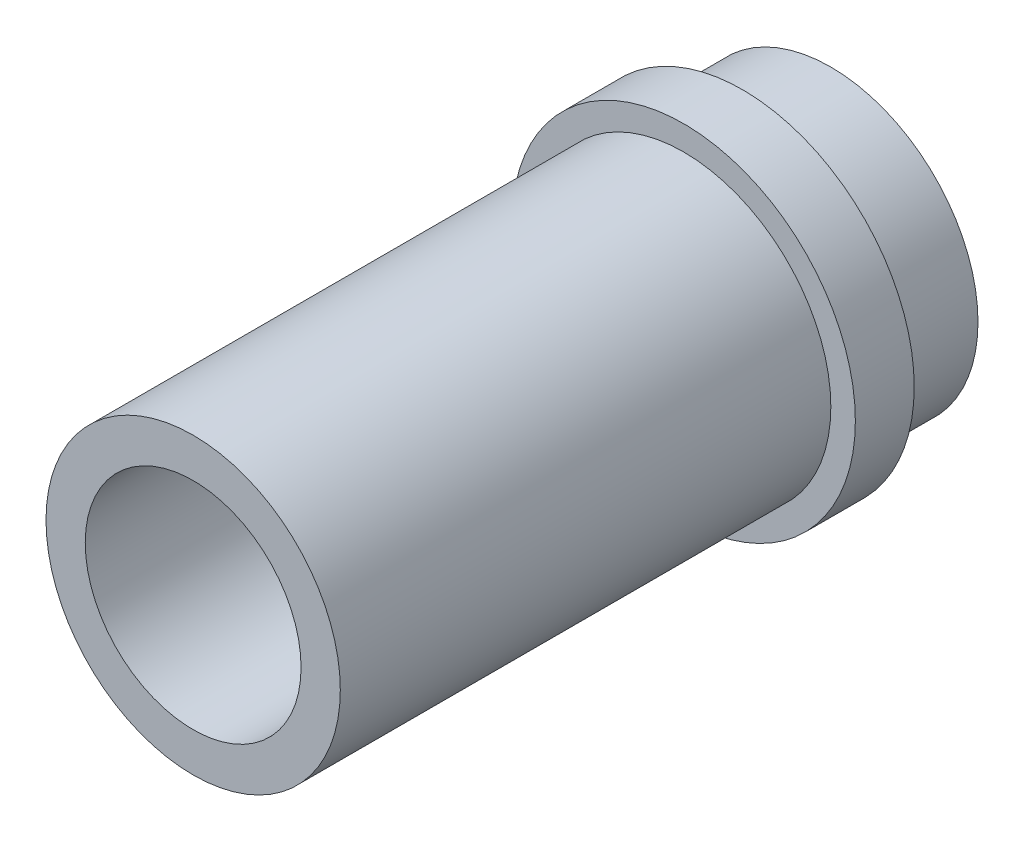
ISO-10303-21;
HEADER;
FILE_DESCRIPTION(('STEP AP214'),'2;1');
FILE_NAME('part.step','',(''),(''),'','','');
FILE_SCHEMA(('AUTOMOTIVE_DESIGN { 1 0 10303 214 1 1 1 1 }'));
ENDSEC;
DATA;
#1=APPLICATION_CONTEXT('core data for automotive mechanical design processes');
#2=APPLICATION_PROTOCOL_DEFINITION('international standard','automotive_design',2000,#1);
#3=PRODUCT_CONTEXT('',#1,'mechanical');
#4=PRODUCT('Part','Part','',(#3));
#5=PRODUCT_RELATED_PRODUCT_CATEGORY('part','',(#4));
#6=PRODUCT_DEFINITION_FORMATION('','',#4);
#7=PRODUCT_DEFINITION_CONTEXT('part definition',#1,'design');
#8=PRODUCT_DEFINITION('design','',#6,#7);
#9=PRODUCT_DEFINITION_SHAPE('','',#8);
#10=(LENGTH_UNIT() NAMED_UNIT(*) SI_UNIT(.MILLI.,.METRE.));
#11=(NAMED_UNIT(*) PLANE_ANGLE_UNIT() SI_UNIT($,.RADIAN.));
#12=(NAMED_UNIT(*) SI_UNIT($,.STERADIAN.) SOLID_ANGLE_UNIT());
#13=UNCERTAINTY_MEASURE_WITH_UNIT(LENGTH_MEASURE(1.E-05),#10,'distance_accuracy_value','');
#14=(GEOMETRIC_REPRESENTATION_CONTEXT(3) GLOBAL_UNCERTAINTY_ASSIGNED_CONTEXT((#13)) GLOBAL_UNIT_ASSIGNED_CONTEXT((#10,
#11,#12)) REPRESENTATION_CONTEXT('',''));
#15=CARTESIAN_POINT('',(0.,0.,0.));
#16=DIRECTION('',(0.,0.,1.));
#17=DIRECTION('',(1.,0.,0.));
#18=AXIS2_PLACEMENT_3D('',#15,#16,#17);
#19=CARTESIAN_POINT('',(-170.,124.,0.));
#20=DIRECTION('',(0.,0.,-1.));
#21=DIRECTION('',(-1.,0.,0.));
#22=AXIS2_PLACEMENT_3D('',#19,#20,#21);
#23=PLANE('',#22);
#24=CARTESIAN_POINT('',(-170.,124.,0.));
#25=DIRECTION('',(0.,0.,-1.));
#26=DIRECTION('',(-1.,0.,0.));
#27=AXIS2_PLACEMENT_3D('',#24,#25,#26);
#28=CIRCLE('',#27,15.);
#29=CARTESIAN_POINT('',(-185.,124.,0.));
#30=VERTEX_POINT('',#29);
#31=EDGE_CURVE('E10',#30,#30,#28,.T.);
#32=ORIENTED_EDGE('',*,*,#31,.F.);
#33=EDGE_LOOP('',(#32));
#34=FACE_BOUND('',#33,.T.);
#35=CARTESIAN_POINT('',(-170.,124.,0.));
#36=DIRECTION('',(0.,0.,-1.));
#37=DIRECTION('',(-1.,0.,0.));
#38=AXIS2_PLACEMENT_3D('',#35,#36,#37);
#39=CIRCLE('',#38,11.);
#40=CARTESIAN_POINT('',(-181.,124.,0.));
#41=VERTEX_POINT('',#40);
#42=EDGE_CURVE('E17',#41,#41,#39,.F.);
#43=ORIENTED_EDGE('',*,*,#42,.F.);
#44=EDGE_LOOP('',(#43));
#45=FACE_BOUND('',#44,.T.);
#46=ADVANCED_FACE('F14',(#34,#45),#23,.F.);
#47=CARTESIAN_POINT('',(-170.,124.,-4.));
#48=DIRECTION('',(0.,0.,-1.));
#49=DIRECTION('',(-1.,0.,0.));
#50=AXIS2_PLACEMENT_3D('',#47,#48,#49);
#51=CYLINDRICAL_SURFACE('',#50,15.);
#52=ORIENTED_EDGE('',*,*,#31,.T.);
#53=EDGE_LOOP('',(#52));
#54=FACE_BOUND('',#53,.T.);
#55=CARTESIAN_POINT('',(-170.,124.,-50.));
#56=DIRECTION('',(0.,0.,-1.));
#57=DIRECTION('',(-1.,0.,0.));
#58=AXIS2_PLACEMENT_3D('',#55,#56,#57);
#59=CIRCLE('',#58,15.);
#60=CARTESIAN_POINT('',(-185.,124.,-50.));
#61=VERTEX_POINT('',#60);
#62=EDGE_CURVE('E21',#61,#61,#59,.T.);
#63=ORIENTED_EDGE('',*,*,#62,.F.);
#64=EDGE_LOOP('',(#63));
#65=FACE_BOUND('',#64,.T.);
#66=ADVANCED_FACE('F64',(#54,#65),#51,.T.);
#67=CARTESIAN_POINT('',(-170.,124.,-50.));
#68=DIRECTION('',(0.,0.,-1.));
#69=DIRECTION('',(-1.,0.,0.));
#70=AXIS2_PLACEMENT_3D('',#67,#68,#69);
#71=PLANE('',#70);
#72=CARTESIAN_POINT('',(-170.,124.,-50.));
#73=DIRECTION('',(0.,0.,-1.));
#74=DIRECTION('',(1.,0.,0.));
#75=AXIS2_PLACEMENT_3D('',#72,#73,#74);
#76=CIRCLE('',#75,17.5);
#77=CARTESIAN_POINT('',(-152.5,124.,-50.));
#78=VERTEX_POINT('',#77);
#79=EDGE_CURVE('E39',#78,#78,#76,.T.);
#80=ORIENTED_EDGE('',*,*,#79,.F.);
#81=EDGE_LOOP('',(#80));
#82=FACE_BOUND('',#81,.T.);
#83=ORIENTED_EDGE('',*,*,#62,.T.);
#84=EDGE_LOOP('',(#83));
#85=FACE_BOUND('',#84,.T.);
#86=ADVANCED_FACE('F69',(#82,#85),#71,.F.);
#87=CARTESIAN_POINT('',(-170.,124.,-65.));
#88=DIRECTION('',(0.,0.,1.));
#89=DIRECTION('',(1.,0.,0.));
#90=AXIS2_PLACEMENT_3D('',#87,#88,#89);
#91=CYLINDRICAL_SURFACE('',#90,15.);
#92=CARTESIAN_POINT('',(-170.,124.,-65.));
#93=DIRECTION('',(0.,0.,-1.));
#94=DIRECTION('',(-1.,0.,0.));
#95=AXIS2_PLACEMENT_3D('',#92,#93,#94);
#96=CIRCLE('',#95,15.);
#97=CARTESIAN_POINT('',(-185.,124.,-65.));
#98=VERTEX_POINT('',#97);
#99=EDGE_CURVE('E25',#98,#98,#96,.T.);
#100=ORIENTED_EDGE('',*,*,#99,.F.);
#101=EDGE_LOOP('',(#100));
#102=FACE_BOUND('',#101,.T.);
#103=CARTESIAN_POINT('',(-170.,124.,-56.));
#104=DIRECTION('',(0.,0.,-1.));
#105=DIRECTION('',(-1.,0.,0.));
#106=AXIS2_PLACEMENT_3D('',#103,#104,#105);
#107=CIRCLE('',#106,15.);
#108=CARTESIAN_POINT('',(-185.,124.,-56.));
#109=VERTEX_POINT('',#108);
#110=EDGE_CURVE('E33',#109,#109,#107,.T.);
#111=ORIENTED_EDGE('',*,*,#110,.T.);
#112=EDGE_LOOP('',(#111));
#113=FACE_BOUND('',#112,.T.);
#114=ADVANCED_FACE('F90',(#102,#113),#91,.T.);
#115=CARTESIAN_POINT('',(-170.,124.,-65.));
#116=DIRECTION('',(0.,0.,-1.));
#117=DIRECTION('',(-1.,0.,0.));
#118=AXIS2_PLACEMENT_3D('',#115,#116,#117);
#119=PLANE('',#118);
#120=CARTESIAN_POINT('',(-170.,124.,-65.));
#121=DIRECTION('',(0.,0.,-1.));
#122=DIRECTION('',(-1.,0.,0.));
#123=AXIS2_PLACEMENT_3D('',#120,#121,#122);
#124=CIRCLE('',#123,9.12435565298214);
#125=CARTESIAN_POINT('',(-179.124355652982,124.,-65.));
#126=VERTEX_POINT('',#125);
#127=EDGE_CURVE('E28',#126,#126,#124,.T.);
#128=ORIENTED_EDGE('',*,*,#127,.F.);
#129=EDGE_LOOP('',(#128));
#130=FACE_BOUND('',#129,.T.);
#131=ORIENTED_EDGE('',*,*,#99,.T.);
#132=EDGE_LOOP('',(#131));
#133=FACE_BOUND('',#132,.T.);
#134=ADVANCED_FACE('F87',(#130,#133),#119,.T.);
#135=CARTESIAN_POINT('',(-170.,124.,-56.));
#136=DIRECTION('',(0.,0.,-1.));
#137=DIRECTION('',(-1.,0.,0.));
#138=AXIS2_PLACEMENT_3D('',#135,#136,#137);
#139=PLANE('',#138);
#140=CARTESIAN_POINT('',(-170.,124.,-56.));
#141=DIRECTION('',(0.,0.,-1.));
#142=DIRECTION('',(1.,0.,0.));
#143=AXIS2_PLACEMENT_3D('',#140,#141,#142);
#144=CIRCLE('',#143,17.5);
#145=CARTESIAN_POINT('',(-152.5,124.,-56.));
#146=VERTEX_POINT('',#145);
#147=EDGE_CURVE('E36',#146,#146,#144,.T.);
#148=ORIENTED_EDGE('',*,*,#147,.T.);
#149=EDGE_LOOP('',(#148));
#150=FACE_BOUND('',#149,.T.);
#151=ORIENTED_EDGE('',*,*,#110,.F.);
#152=EDGE_LOOP('',(#151));
#153=FACE_BOUND('',#152,.T.);
#154=ADVANCED_FACE('F80',(#150,#153),#139,.T.);
#155=CARTESIAN_POINT('',(-170.,124.,-56.));
#156=DIRECTION('',(0.,0.,1.));
#157=DIRECTION('',(1.,0.,0.));
#158=AXIS2_PLACEMENT_3D('',#155,#156,#157);
#159=CYLINDRICAL_SURFACE('',#158,17.5);
#160=ORIENTED_EDGE('',*,*,#147,.F.);
#161=EDGE_LOOP('',(#160));
#162=FACE_BOUND('',#161,.T.);
#163=ORIENTED_EDGE('',*,*,#79,.T.);
#164=EDGE_LOOP('',(#163));
#165=FACE_BOUND('',#164,.T.);
#166=ADVANCED_FACE('F75',(#162,#165),#159,.T.);
#167=CARTESIAN_POINT('',(-170.,124.,-45.6));
#168=DIRECTION('',(0.,0.,1.));
#169=DIRECTION('',(1.,0.,0.));
#170=AXIS2_PLACEMENT_3D('',#167,#168,#169);
#171=CYLINDRICAL_SURFACE('',#170,11.);
#172=CARTESIAN_POINT('',(-170.,124.,-38.6));
#173=DIRECTION('',(0.,0.,-1.));
#174=DIRECTION('',(-1.,0.,0.));
#175=AXIS2_PLACEMENT_3D('',#172,#173,#174);
#176=CIRCLE('',#175,11.);
#177=CARTESIAN_POINT('',(-181.,124.,-38.6));
#178=VERTEX_POINT('',#177);
#179=EDGE_CURVE('E30',#178,#178,#176,.F.);
#180=ORIENTED_EDGE('',*,*,#179,.F.);
#181=EDGE_LOOP('',(#180));
#182=FACE_BOUND('',#181,.T.);
#183=ORIENTED_EDGE('',*,*,#42,.T.);
#184=EDGE_LOOP('',(#183));
#185=FACE_BOUND('',#184,.T.);
#186=ADVANCED_FACE('F59',(#182,#185),#171,.F.);
#187=CARTESIAN_POINT('',(-170.,124.,-45.6));
#188=DIRECTION('',(0.,0.,1.));
#189=DIRECTION('',(1.,0.,0.));
#190=AXIS2_PLACEMENT_3D('',#187,#188,#189);
#191=CONICAL_SURFACE('',#190,9.12435565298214,0.26179938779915);
#192=ORIENTED_EDGE('',*,*,#179,.T.);
#193=EDGE_LOOP('',(#192));
#194=FACE_BOUND('',#193,.T.);
#195=CARTESIAN_POINT('',(-170.,124.,-45.6));
#196=DIRECTION('',(0.,0.,-1.));
#197=DIRECTION('',(-1.,0.,0.));
#198=AXIS2_PLACEMENT_3D('',#195,#196,#197);
#199=CIRCLE('',#198,9.12435565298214);
#200=CARTESIAN_POINT('',(-179.124355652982,124.,-45.6));
#201=VERTEX_POINT('',#200);
#202=EDGE_CURVE('E31',#201,#201,#199,.T.);
#203=ORIENTED_EDGE('',*,*,#202,.T.);
#204=EDGE_LOOP('',(#203));
#205=FACE_BOUND('',#204,.T.);
#206=ADVANCED_FACE('F49',(#194,#205),#191,.F.);
#207=CARTESIAN_POINT('',(-170.,124.,-45.6));
#208=DIRECTION('',(0.,0.,-1.));
#209=DIRECTION('',(-1.,0.,0.));
#210=AXIS2_PLACEMENT_3D('',#207,#208,#209);
#211=CYLINDRICAL_SURFACE('',#210,9.12435565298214);
#212=ORIENTED_EDGE('',*,*,#127,.T.);
#213=EDGE_LOOP('',(#212));
#214=FACE_BOUND('',#213,.T.);
#215=ORIENTED_EDGE('',*,*,#202,.F.);
#216=EDGE_LOOP('',(#215));
#217=FACE_BOUND('',#216,.T.);
#218=ADVANCED_FACE('F51',(#214,#217),#211,.F.);
#219=CLOSED_SHELL('',(#46,#66,#86,#114,#134,#154,#166,#186,#206,#218));
#220=MANIFOLD_SOLID_BREP('B1',#219);
#221=ADVANCED_BREP_SHAPE_REPRESENTATION('',(#18,#220),#14);
#222=SHAPE_DEFINITION_REPRESENTATION(#9,#221);
ENDSEC;
END-ISO-10303-21;
